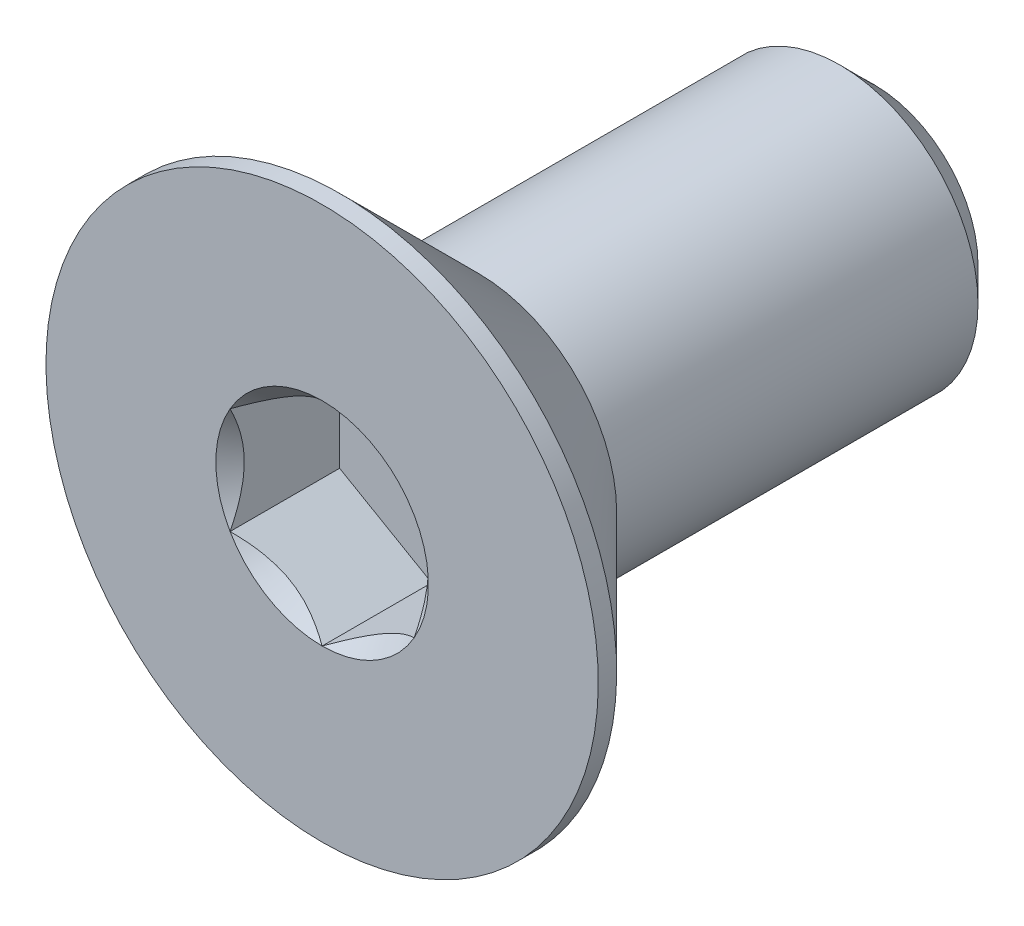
ISO-10303-21;
HEADER;
FILE_DESCRIPTION(('STEP AP214'),'2;1');
FILE_NAME('part.step','',(''),(''),'','','');
FILE_SCHEMA(('AUTOMOTIVE_DESIGN { 1 0 10303 214 1 1 1 1 }'));
ENDSEC;
DATA;
#1=APPLICATION_CONTEXT('core data for automotive mechanical design processes');
#2=APPLICATION_PROTOCOL_DEFINITION('international standard','automotive_design',2000,#1);
#3=PRODUCT_CONTEXT('',#1,'mechanical');
#4=PRODUCT('Part','Part','',(#3));
#5=PRODUCT_RELATED_PRODUCT_CATEGORY('part','',(#4));
#6=PRODUCT_DEFINITION_FORMATION('','',#4);
#7=PRODUCT_DEFINITION_CONTEXT('part definition',#1,'design');
#8=PRODUCT_DEFINITION('design','',#6,#7);
#9=PRODUCT_DEFINITION_SHAPE('','',#8);
#10=(LENGTH_UNIT() NAMED_UNIT(*) SI_UNIT(.MILLI.,.METRE.));
#11=(NAMED_UNIT(*) PLANE_ANGLE_UNIT() SI_UNIT($,.RADIAN.));
#12=(NAMED_UNIT(*) SI_UNIT($,.STERADIAN.) SOLID_ANGLE_UNIT());
#13=UNCERTAINTY_MEASURE_WITH_UNIT(LENGTH_MEASURE(1.E-05),#10,'distance_accuracy_value','');
#14=(GEOMETRIC_REPRESENTATION_CONTEXT(3) GLOBAL_UNCERTAINTY_ASSIGNED_CONTEXT((#13)) GLOBAL_UNIT_ASSIGNED_CONTEXT((#10,
#11,#12)) REPRESENTATION_CONTEXT('',''));
#15=CARTESIAN_POINT('',(0.,0.,0.));
#16=DIRECTION('',(0.,0.,1.));
#17=DIRECTION('',(1.,0.,0.));
#18=AXIS2_PLACEMENT_3D('',#15,#16,#17);
#19=CARTESIAN_POINT('',(0.,0.,-6.));
#20=DIRECTION('',(0.,0.,-1.));
#21=DIRECTION('',(0.,1.,0.));
#22=AXIS2_PLACEMENT_3D('',#19,#20,#21);
#23=CYLINDRICAL_SURFACE('',#22,1.5);
#24=CARTESIAN_POINT('',(0.,0.,-5.625));
#25=DIRECTION('',(0.,0.,-1.));
#26=DIRECTION('',(0.,1.,0.));
#27=AXIS2_PLACEMENT_3D('',#24,#25,#26);
#28=CIRCLE('',#27,1.5);
#29=CARTESIAN_POINT('',(0.,-1.5,-5.625));
#30=VERTEX_POINT('',#29);
#31=EDGE_CURVE('E49',#30,#30,#28,.F.);
#32=ORIENTED_EDGE('',*,*,#31,.T.);
#33=EDGE_LOOP('',(#32));
#34=FACE_BOUND('',#33,.T.);
#35=CARTESIAN_POINT('',(0.,0.,-1.7));
#36=DIRECTION('',(0.,0.,1.));
#37=DIRECTION('',(0.,-1.,0.));
#38=AXIS2_PLACEMENT_3D('',#35,#36,#37);
#39=CIRCLE('',#38,1.5);
#40=CARTESIAN_POINT('',(0.,-1.5,-1.7));
#41=VERTEX_POINT('',#40);
#42=EDGE_CURVE('E167',#41,#41,#39,.T.);
#43=ORIENTED_EDGE('',*,*,#42,.F.);
#44=EDGE_LOOP('',(#43));
#45=FACE_BOUND('',#44,.T.);
#46=ADVANCED_FACE('F36',(#34,#45),#23,.T.);
#47=CARTESIAN_POINT('',(0.,-1.5,-6.));
#48=DIRECTION('',(0.,0.,-1.));
#49=DIRECTION('',(0.,1.,0.));
#50=AXIS2_PLACEMENT_3D('',#47,#48,#49);
#51=PLANE('',#50);
#52=CARTESIAN_POINT('',(0.,0.,-6.));
#53=DIRECTION('',(0.,0.,-1.));
#54=DIRECTION('',(0.,1.,0.));
#55=AXIS2_PLACEMENT_3D('',#52,#53,#54);
#56=CIRCLE('',#55,1.125);
#57=CARTESIAN_POINT('',(0.,-1.125,-6.));
#58=VERTEX_POINT('',#57);
#59=EDGE_CURVE('E176',#58,#58,#56,.T.);
#60=ORIENTED_EDGE('',*,*,#59,.T.);
#61=EDGE_LOOP('',(#60));
#62=FACE_BOUND('',#61,.T.);
#63=ADVANCED_FACE('F186',(#62),#51,.T.);
#64=CARTESIAN_POINT('',(0.,0.,-6.));
#65=DIRECTION('',(0.,0.,1.));
#66=DIRECTION('',(0.,-1.,0.));
#67=AXIS2_PLACEMENT_3D('',#64,#65,#66);
#68=CONICAL_SURFACE('',#67,1.125,0.785398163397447);
#69=CARTESIAN_POINT('',(0.,-1.5,-5.625));
#70=CARTESIAN_POINT('',(0.,-1.49609375,-5.62890625));
#71=CARTESIAN_POINT('',(0.,-1.4921875,-5.6328125));
#72=CARTESIAN_POINT('',(0.,-1.484375,-5.640625));
#73=CARTESIAN_POINT('',(0.,-1.48046875,-5.64453125));
#74=CARTESIAN_POINT('',(0.,-1.47265625,-5.65234375));
#75=CARTESIAN_POINT('',(0.,-1.46875,-5.65625));
#76=CARTESIAN_POINT('',(0.,-1.4609375,-5.6640625));
#77=CARTESIAN_POINT('',(0.,-1.45703125,-5.66796875));
#78=CARTESIAN_POINT('',(0.,-1.44921875,-5.67578125));
#79=CARTESIAN_POINT('',(0.,-1.4453125,-5.6796875));
#80=CARTESIAN_POINT('',(0.,-1.4375,-5.6875));
#81=CARTESIAN_POINT('',(0.,-1.43359375,-5.69140625));
#82=CARTESIAN_POINT('',(0.,-1.42578125,-5.69921875));
#83=CARTESIAN_POINT('',(0.,-1.421875,-5.703125));
#84=CARTESIAN_POINT('',(0.,-1.4140625,-5.7109375));
#85=CARTESIAN_POINT('',(0.,-1.41015625,-5.71484375));
#86=CARTESIAN_POINT('',(0.,-1.40234375,-5.72265625));
#87=CARTESIAN_POINT('',(0.,-1.3984375,-5.7265625));
#88=CARTESIAN_POINT('',(0.,-1.390625,-5.734375));
#89=CARTESIAN_POINT('',(0.,-1.38671875,-5.73828125));
#90=CARTESIAN_POINT('',(0.,-1.37890625,-5.74609375));
#91=CARTESIAN_POINT('',(0.,-1.375,-5.75));
#92=CARTESIAN_POINT('',(0.,-1.3671875,-5.7578125));
#93=CARTESIAN_POINT('',(0.,-1.36328125,-5.76171875));
#94=CARTESIAN_POINT('',(0.,-1.35546875,-5.76953125));
#95=CARTESIAN_POINT('',(0.,-1.3515625,-5.7734375));
#96=CARTESIAN_POINT('',(0.,-1.34375,-5.78125));
#97=CARTESIAN_POINT('',(0.,-1.33984375,-5.78515625));
#98=CARTESIAN_POINT('',(0.,-1.33203125,-5.79296875));
#99=CARTESIAN_POINT('',(0.,-1.328125,-5.796875));
#100=CARTESIAN_POINT('',(0.,-1.3203125,-5.8046875));
#101=CARTESIAN_POINT('',(0.,-1.31640625,-5.80859375));
#102=CARTESIAN_POINT('',(0.,-1.30859375,-5.81640625));
#103=CARTESIAN_POINT('',(0.,-1.3046875,-5.8203125));
#104=CARTESIAN_POINT('',(0.,-1.296875,-5.828125));
#105=CARTESIAN_POINT('',(0.,-1.29296875,-5.83203125));
#106=CARTESIAN_POINT('',(0.,-1.28515625,-5.83984375));
#107=CARTESIAN_POINT('',(0.,-1.28125,-5.84375));
#108=CARTESIAN_POINT('',(0.,-1.2734375,-5.8515625));
#109=CARTESIAN_POINT('',(0.,-1.26953125,-5.85546875));
#110=CARTESIAN_POINT('',(0.,-1.26171875,-5.86328125));
#111=CARTESIAN_POINT('',(0.,-1.2578125,-5.8671875));
#112=CARTESIAN_POINT('',(0.,-1.25,-5.875));
#113=CARTESIAN_POINT('',(0.,-1.24609375,-5.87890625));
#114=CARTESIAN_POINT('',(0.,-1.23828125,-5.88671875));
#115=CARTESIAN_POINT('',(0.,-1.234375,-5.890625));
#116=CARTESIAN_POINT('',(0.,-1.2265625,-5.8984375));
#117=CARTESIAN_POINT('',(0.,-1.22265625,-5.90234375));
#118=CARTESIAN_POINT('',(0.,-1.21484375,-5.91015625));
#119=CARTESIAN_POINT('',(0.,-1.2109375,-5.9140625));
#120=CARTESIAN_POINT('',(0.,-1.203125,-5.921875));
#121=CARTESIAN_POINT('',(0.,-1.19921875,-5.92578125));
#122=CARTESIAN_POINT('',(0.,-1.19140625,-5.93359375));
#123=CARTESIAN_POINT('',(0.,-1.1875,-5.9375));
#124=CARTESIAN_POINT('',(0.,-1.1796875,-5.9453125));
#125=CARTESIAN_POINT('',(0.,-1.17578125,-5.94921875));
#126=CARTESIAN_POINT('',(0.,-1.16796875,-5.95703125));
#127=CARTESIAN_POINT('',(0.,-1.1640625,-5.9609375));
#128=CARTESIAN_POINT('',(0.,-1.15625,-5.96875));
#129=CARTESIAN_POINT('',(0.,-1.15234375,-5.97265625));
#130=CARTESIAN_POINT('',(0.,-1.14453125,-5.98046875));
#131=CARTESIAN_POINT('',(0.,-1.140625,-5.984375));
#132=CARTESIAN_POINT('',(0.,-1.1328125,-5.9921875));
#133=CARTESIAN_POINT('',(0.,-1.12890625,-5.99609375));
#134=CARTESIAN_POINT('',(0.,-1.125,-6.));
#135=B_SPLINE_CURVE_WITH_KNOTS('',3,(#69,#70,#71,#72,#73,#74,#75,#76,#77,#78,#79,#80,#81,#82,
#83,#84,#85,#86,#87,#88,#89,#90,#91,#92,#93,#94,#95,#96,#97,#98,#99,#100,#101,#102,#103,#104,
#105,#106,#107,#108,#109,#110,#111,#112,#113,#114,#115,#116,#117,#118,#119,#120,#121,#122,#123,
#124,#125,#126,#127,#128,#129,#130,#131,#132,#133,#134),.UNSPECIFIED.,.F.,.F.,(4,2,2,2,2,2,2,2,
2,2,2,2,2,2,2,2,2,2,2,2,2,2,2,2,2,2,2,2,2,2,2,2,4),(0.,0.0165728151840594,0.0331456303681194,
0.0497184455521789,0.0662912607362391,0.0828640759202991,0.0994368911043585,0.116009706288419,
0.132582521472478,0.149155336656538,0.165728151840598,0.182300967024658,0.198873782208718,
0.215446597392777,0.232019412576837,0.248592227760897,0.265165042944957,0.281737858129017,
0.298310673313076,0.314883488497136,0.331456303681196,0.348029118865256,0.364601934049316,
0.381174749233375,0.397747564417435,0.414320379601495,0.430893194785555,0.447466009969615,
0.464038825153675,0.480611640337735,0.497184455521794,0.513757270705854,0.530330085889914),.UNSPECIFIED.);
#136=EDGE_CURVE('BSEAM38',#30,#58,#135,.T.);
#137=ORIENTED_EDGE('',*,*,#31,.F.);
#138=ORIENTED_EDGE('',*,*,#59,.F.);
#139=ORIENTED_EDGE('',*,*,#136,.T.);
#140=ORIENTED_EDGE('',*,*,#136,.F.);
#141=EDGE_LOOP('',(#137,#139,#138,#140));
#142=FACE_BOUND('',#141,.T.);
#143=ADVANCED_FACE('F38',(#142),#68,.T.);
#144=CARTESIAN_POINT('',(0.,0.,0.));
#145=DIRECTION('',(0.,0.,1.));
#146=DIRECTION('',(0.,-1.,0.));
#147=AXIS2_PLACEMENT_3D('',#144,#145,#146);
#148=CYLINDRICAL_SURFACE('',#147,3.);
#149=CARTESIAN_POINT('',(0.,0.,0.));
#150=DIRECTION('',(0.,0.,1.));
#151=DIRECTION('',(0.,-1.,0.));
#152=AXIS2_PLACEMENT_3D('',#149,#150,#151);
#153=CIRCLE('',#152,3.);
#154=CARTESIAN_POINT('',(0.,-3.,0.));
#155=VERTEX_POINT('',#154);
#156=EDGE_CURVE('E173',#155,#155,#153,.T.);
#157=ORIENTED_EDGE('',*,*,#156,.F.);
#158=EDGE_LOOP('',(#157));
#159=FACE_BOUND('',#158,.T.);
#160=CARTESIAN_POINT('',(0.,0.,-0.200000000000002));
#161=DIRECTION('',(0.,0.,1.));
#162=DIRECTION('',(0.,-1.,0.));
#163=AXIS2_PLACEMENT_3D('',#160,#161,#162);
#164=CIRCLE('',#163,3.);
#165=CARTESIAN_POINT('',(0.,-3.,-0.199999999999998));
#166=VERTEX_POINT('',#165);
#167=EDGE_CURVE('E170',#166,#166,#164,.T.);
#168=ORIENTED_EDGE('',*,*,#167,.T.);
#169=EDGE_LOOP('',(#168));
#170=FACE_BOUND('',#169,.T.);
#171=ADVANCED_FACE('F185',(#159,#170),#148,.T.);
#172=CARTESIAN_POINT('',(0.,0.,-1.7));
#173=DIRECTION('',(0.,0.,1.));
#174=DIRECTION('',(0.,-1.,0.));
#175=AXIS2_PLACEMENT_3D('',#172,#173,#174);
#176=CONICAL_SURFACE('',#175,1.5,0.785398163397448);
#177=ORIENTED_EDGE('',*,*,#167,.F.);
#178=EDGE_LOOP('',(#177));
#179=FACE_BOUND('',#178,.T.);
#180=ORIENTED_EDGE('',*,*,#42,.T.);
#181=EDGE_LOOP('',(#180));
#182=FACE_BOUND('',#181,.T.);
#183=ADVANCED_FACE('F196',(#179,#182),#176,.T.);
#184=CARTESIAN_POINT('',(0.,-1.5,0.));
#185=DIRECTION('',(0.,0.,1.));
#186=DIRECTION('',(0.,-1.,0.));
#187=AXIS2_PLACEMENT_3D('',#184,#185,#186);
#188=PLANE('',#187);
#189=CARTESIAN_POINT('',(0.,0.,0.));
#190=DIRECTION('',(0.,0.,1.));
#191=DIRECTION('',(1.,0.,0.));
#192=AXIS2_PLACEMENT_3D('',#189,#190,#191);
#193=CIRCLE('',#192,1.15470053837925);
#194=CARTESIAN_POINT('',(0.,-1.15470053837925,0.));
#195=VERTEX_POINT('',#194);
#196=CARTESIAN_POINT('',(0.999999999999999,-0.577350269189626,0.));
#197=VERTEX_POINT('',#196);
#198=EDGE_CURVE('E95',#195,#197,#193,.T.);
#199=ORIENTED_EDGE('',*,*,#198,.F.);
#200=CARTESIAN_POINT('',(-1.,-0.577350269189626,0.));
#201=VERTEX_POINT('',#200);
#202=EDGE_CURVE('E55',#201,#195,#193,.T.);
#203=ORIENTED_EDGE('',*,*,#202,.F.);
#204=CARTESIAN_POINT('',(-0.999999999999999,0.577350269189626,0.));
#205=VERTEX_POINT('',#204);
#206=EDGE_CURVE('E137',#205,#201,#193,.T.);
#207=ORIENTED_EDGE('',*,*,#206,.F.);
#208=CARTESIAN_POINT('',(0.,1.15470053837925,0.));
#209=VERTEX_POINT('',#208);
#210=EDGE_CURVE('E62',#209,#205,#193,.T.);
#211=ORIENTED_EDGE('',*,*,#210,.F.);
#212=CARTESIAN_POINT('',(0.999999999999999,0.577350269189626,0.));
#213=VERTEX_POINT('',#212);
#214=EDGE_CURVE('E131',#213,#209,#193,.T.);
#215=ORIENTED_EDGE('',*,*,#214,.F.);
#216=EDGE_CURVE('E103',#197,#213,#193,.T.);
#217=ORIENTED_EDGE('',*,*,#216,.F.);
#218=EDGE_LOOP('',(#199,#203,#207,#211,#215,#217));
#219=FACE_BOUND('',#218,.T.);
#220=ORIENTED_EDGE('',*,*,#156,.T.);
#221=EDGE_LOOP('',(#220));
#222=FACE_BOUND('',#221,.T.);
#223=ADVANCED_FACE('F129',(#219,#222),#188,.T.);
#224=CARTESIAN_POINT('',(0.,0.,0.));
#225=DIRECTION('',(0.,0.,1.));
#226=DIRECTION('',(1.,0.,0.));
#227=AXIS2_PLACEMENT_3D('',#224,#225,#226);
#228=CONICAL_SURFACE('',#227,1.15470053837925,0.78539816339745);
#229=ORIENTED_EDGE('',*,*,#216,.T.);
#230=CARTESIAN_POINT('',(0.999999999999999,-1.15147208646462,0.370385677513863));
#231=CARTESIAN_POINT('',(0.999999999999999,-1.12343447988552,0.349219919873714));
#232=CARTESIAN_POINT('',(0.999999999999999,-1.09524064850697,0.328261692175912));
#233=CARTESIAN_POINT('',(0.999999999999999,-1.03847715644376,0.286846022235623));
#234=CARTESIAN_POINT('',(0.999999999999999,-1.00990740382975,0.26638870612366));
#235=CARTESIAN_POINT('',(0.999999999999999,-0.923120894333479,0.20560479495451));
#236=CARTESIAN_POINT('',(0.999999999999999,-0.864253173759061,0.166192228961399));
#237=CARTESIAN_POINT('',(0.999999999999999,-0.740809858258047,0.0888206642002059));
#238=CARTESIAN_POINT('',(0.999999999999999,-0.676100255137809,0.0510730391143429));
#239=CARTESIAN_POINT('',(0.999999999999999,-0.543448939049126,-0.017975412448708));
#240=CARTESIAN_POINT('',(0.999999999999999,-0.47551911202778,-0.0492979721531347));
#241=CARTESIAN_POINT('',(0.999999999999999,-0.37355585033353,-0.0876182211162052));
#242=CARTESIAN_POINT('',(0.999999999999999,-0.341031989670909,-0.0986164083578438));
#243=CARTESIAN_POINT('',(0.999999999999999,-0.275199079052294,-0.11800165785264));
#244=CARTESIAN_POINT('',(0.999999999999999,-0.241889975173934,-0.126388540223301));
#245=CARTESIAN_POINT('',(0.999999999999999,-0.175247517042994,-0.139974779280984));
#246=CARTESIAN_POINT('',(0.999999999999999,-0.141925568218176,-0.145229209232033));
#247=CARTESIAN_POINT('',(0.999999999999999,-0.0749144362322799,-0.152451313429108));
#248=CARTESIAN_POINT('',(0.999999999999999,-0.0412251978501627,-0.154418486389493));
#249=CARTESIAN_POINT('',(0.999999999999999,0.0249580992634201,-0.15491680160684));
#250=CARTESIAN_POINT('',(0.999999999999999,0.0574512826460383,-0.153569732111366));
#251=CARTESIAN_POINT('',(0.999999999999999,0.122148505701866,-0.147783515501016));
#252=CARTESIAN_POINT('',(0.999999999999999,0.154352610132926,-0.143345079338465));
#253=CARTESIAN_POINT('',(0.999999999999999,0.218799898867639,-0.131543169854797));
#254=CARTESIAN_POINT('',(0.999999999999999,0.251033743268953,-0.124129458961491));
#255=CARTESIAN_POINT('',(0.999999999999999,0.314797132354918,-0.106771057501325));
#256=CARTESIAN_POINT('',(0.999999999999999,0.346326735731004,-0.0968265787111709));
#257=CARTESIAN_POINT('',(0.999999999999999,0.445594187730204,-0.0617765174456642));
#258=CARTESIAN_POINT('',(0.999999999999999,0.511919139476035,-0.0326791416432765));
#259=CARTESIAN_POINT('',(0.999999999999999,0.64145324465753,0.0320153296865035));
#260=CARTESIAN_POINT('',(0.999999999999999,0.704650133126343,0.0676357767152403));
#261=CARTESIAN_POINT('',(0.999999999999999,0.825428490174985,0.141123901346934));
#262=CARTESIAN_POINT('',(0.999999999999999,0.883132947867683,0.178791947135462));
#263=CARTESIAN_POINT('',(0.999999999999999,0.968148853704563,0.237022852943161));
#264=CARTESIAN_POINT('',(0.999999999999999,0.996120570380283,0.256638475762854));
#265=CARTESIAN_POINT('',(0.999999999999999,1.05168177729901,0.296388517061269));
#266=CARTESIAN_POINT('',(0.999999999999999,1.079271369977,0.316522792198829));
#267=CARTESIAN_POINT('',(0.999999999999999,1.10670185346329,0.336872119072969));
#268=B_SPLINE_CURVE_WITH_KNOTS('',3,(#230,#231,#232,#233,#234,#235,#236,#237,#238,#239,#240,
#241,#242,#243,#244,#245,#246,#247,#248,#249,#250,#251,#252,#253,#254,#255,#256,#257,#258,#259,
#260,#261,#262,#263,#264,#265,#266,#267),.UNSPECIFIED.,.F.,.F.,(4,2,2,2,2,2,2,2,2,2,2,2,2,2,2,2,
2,2,4),(0.,0.105386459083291,0.210799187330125,0.42323361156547,0.647793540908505,
0.871580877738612,0.974493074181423,1.07741235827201,1.17846428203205,1.27953161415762,
1.37694086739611,1.47432772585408,1.57343322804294,1.67253043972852,1.88917353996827,
2.10660791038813,2.31323734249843,2.41572589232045,2.51818641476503),.UNSPECIFIED.);
#269=EDGE_CURVE('E11',#197,#213,#268,.T.);
#270=ORIENTED_EDGE('',*,*,#269,.F.);
#271=EDGE_LOOP('',(#229,#270));
#272=FACE_BOUND('',#271,.T.);
#273=ADVANCED_FACE('F107',(#272),#228,.F.);
#274=ORIENTED_EDGE('',*,*,#214,.T.);
#275=CARTESIAN_POINT('',(1.0002,0.577234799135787,0.000115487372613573));
#276=CARTESIAN_POINT('',(0.965817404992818,0.597085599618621,-0.0197220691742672));
#277=CARTESIAN_POINT('',(0.930859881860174,0.617268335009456,-0.0383949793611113));
#278=CARTESIAN_POINT('',(0.85957719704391,0.658423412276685,-0.0725852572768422));
#279=CARTESIAN_POINT('',(0.823245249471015,0.679399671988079,-0.0880835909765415));
#280=CARTESIAN_POINT('',(0.749983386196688,0.721697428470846,-0.114632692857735));
#281=CARTESIAN_POINT('',(0.713072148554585,0.743008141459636,-0.125750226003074));
#282=CARTESIAN_POINT('',(0.63843727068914,0.786098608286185,-0.142880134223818));
#283=CARTESIAN_POINT('',(0.600715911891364,0.80787704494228,-0.148905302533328));
#284=CARTESIAN_POINT('',(0.535707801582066,0.845409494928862,-0.154339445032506));
#285=CARTESIAN_POINT('',(0.508505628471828,0.861114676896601,-0.155143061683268));
#286=CARTESIAN_POINT('',(0.454153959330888,0.892494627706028,-0.153793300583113));
#287=CARTESIAN_POINT('',(0.427004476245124,0.908169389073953,-0.151639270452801));
#288=CARTESIAN_POINT('',(0.34594372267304,0.95496983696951,-0.140883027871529));
#289=CARTESIAN_POINT('',(0.292435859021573,0.985862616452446,-0.127985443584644));
#290=CARTESIAN_POINT('',(0.198523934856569,1.04008269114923,-0.0968592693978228));
#291=CARTESIAN_POINT('',(0.157679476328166,1.0636642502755,-0.0802622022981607));
#292=CARTESIAN_POINT('',(0.0775903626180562,1.1099037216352,-0.0428750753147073));
#293=CARTESIAN_POINT('',(0.0383409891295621,1.1325643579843,-0.0220986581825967));
#294=CARTESIAN_POINT('',(-0.000200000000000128,1.15481600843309,0.000115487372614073));
#295=B_SPLINE_CURVE_WITH_KNOTS('',3,(#275,#276,#277,#278,#279,#280,#281,#282,#283,#284,#285,
#286,#287,#288,#289,#290,#291,#292,#293,#294),.UNSPECIFIED.,.F.,.F.,(4,2,2,2,2,2,2,2,2,4),(0.,
0.133237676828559,0.26725222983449,0.3991370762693,0.530689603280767,0.624814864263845,
0.718960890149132,0.907306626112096,1.05710100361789,1.20641411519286),.UNSPECIFIED.);
#296=EDGE_CURVE('E133',#213,#209,#295,.T.);
#297=ORIENTED_EDGE('',*,*,#296,.F.);
#298=EDGE_LOOP('',(#274,#297));
#299=FACE_BOUND('',#298,.T.);
#300=ADVANCED_FACE('F272',(#299),#228,.F.);
#301=ORIENTED_EDGE('',*,*,#210,.T.);
#302=CARTESIAN_POINT('',(0.000199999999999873,1.15481600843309,0.000115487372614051));
#303=CARTESIAN_POINT('',(-0.0341825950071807,1.13496520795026,-0.0197220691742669));
#304=CARTESIAN_POINT('',(-0.0691401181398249,1.11478247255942,-0.038394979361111));
#305=CARTESIAN_POINT('',(-0.140422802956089,1.07362739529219,-0.0725852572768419));
#306=CARTESIAN_POINT('',(-0.176754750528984,1.0526511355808,-0.0880835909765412));
#307=CARTESIAN_POINT('',(-0.250016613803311,1.01035337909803,-0.114632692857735));
#308=CARTESIAN_POINT('',(-0.286927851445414,0.98904266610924,-0.125750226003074));
#309=CARTESIAN_POINT('',(-0.361562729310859,0.945952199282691,-0.142880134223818));
#310=CARTESIAN_POINT('',(-0.399284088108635,0.924173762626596,-0.148905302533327));
#311=CARTESIAN_POINT('',(-0.464292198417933,0.886641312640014,-0.154339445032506));
#312=CARTESIAN_POINT('',(-0.491494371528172,0.870936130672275,-0.155143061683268));
#313=CARTESIAN_POINT('',(-0.545846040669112,0.839556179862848,-0.153793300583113));
#314=CARTESIAN_POINT('',(-0.572995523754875,0.823881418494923,-0.1516392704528));
#315=CARTESIAN_POINT('',(-0.65405627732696,0.777080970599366,-0.140883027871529));
#316=CARTESIAN_POINT('',(-0.707564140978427,0.74618819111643,-0.127985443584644));
#317=CARTESIAN_POINT('',(-0.801476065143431,0.691968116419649,-0.0968592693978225));
#318=CARTESIAN_POINT('',(-0.842320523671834,0.668386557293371,-0.0802622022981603));
#319=CARTESIAN_POINT('',(-0.922409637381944,0.622147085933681,-0.0428750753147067));
#320=CARTESIAN_POINT('',(-0.961659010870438,0.599486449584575,-0.022098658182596));
#321=CARTESIAN_POINT('',(-1.0002,0.577234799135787,0.000115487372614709));
#322=B_SPLINE_CURVE_WITH_KNOTS('',3,(#302,#303,#304,#305,#306,#307,#308,#309,#310,#311,#312,
#313,#314,#315,#316,#317,#318,#319,#320,#321),.UNSPECIFIED.,.F.,.F.,(4,2,2,2,2,2,2,2,2,4),(0.,
0.133237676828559,0.26725222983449,0.3991370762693,0.530689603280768,0.624814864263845,
0.718960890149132,0.907306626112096,1.05710100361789,1.20641411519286),.UNSPECIFIED.);
#323=EDGE_CURVE('E136',#209,#205,#322,.T.);
#324=ORIENTED_EDGE('',*,*,#323,.F.);
#325=EDGE_LOOP('',(#301,#324));
#326=FACE_BOUND('',#325,.T.);
#327=ADVANCED_FACE('F268',(#326),#228,.F.);
#328=ORIENTED_EDGE('',*,*,#206,.T.);
#329=CARTESIAN_POINT('',(-1.,-1.15147208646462,0.370385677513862));
#330=CARTESIAN_POINT('',(-1.,-1.12343447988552,0.349219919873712));
#331=CARTESIAN_POINT('',(-1.,-1.09524064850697,0.32826169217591));
#332=CARTESIAN_POINT('',(-1.,-1.03847715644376,0.286846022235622));
#333=CARTESIAN_POINT('',(-1.,-1.00990740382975,0.266388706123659));
#334=CARTESIAN_POINT('',(-1.,-0.923120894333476,0.20560479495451));
#335=CARTESIAN_POINT('',(-1.,-0.864253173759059,0.166192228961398));
#336=CARTESIAN_POINT('',(-1.,-0.740809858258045,0.0888206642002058));
#337=CARTESIAN_POINT('',(-1.,-0.676100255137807,0.0510730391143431));
#338=CARTESIAN_POINT('',(-1.,-0.543448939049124,-0.0179754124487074));
#339=CARTESIAN_POINT('',(-1.,-0.475519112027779,-0.0492979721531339));
#340=CARTESIAN_POINT('',(-1.,-0.373555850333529,-0.0876182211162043));
#341=CARTESIAN_POINT('',(-1.,-0.341031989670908,-0.0986164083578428));
#342=CARTESIAN_POINT('',(-1.,-0.275199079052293,-0.118001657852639));
#343=CARTESIAN_POINT('',(-1.,-0.241889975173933,-0.1263885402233));
#344=CARTESIAN_POINT('',(-1.,-0.175247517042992,-0.139974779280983));
#345=CARTESIAN_POINT('',(-1.,-0.141925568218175,-0.145229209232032));
#346=CARTESIAN_POINT('',(-1.,-0.0749144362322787,-0.152451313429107));
#347=CARTESIAN_POINT('',(-1.,-0.0412251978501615,-0.154418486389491));
#348=CARTESIAN_POINT('',(-1.,0.0249580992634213,-0.154916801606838));
#349=CARTESIAN_POINT('',(-1.,0.0574512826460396,-0.153569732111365));
#350=CARTESIAN_POINT('',(-1.,0.122148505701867,-0.147783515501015));
#351=CARTESIAN_POINT('',(-1.,0.154352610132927,-0.143345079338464));
#352=CARTESIAN_POINT('',(-1.,0.21879989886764,-0.131543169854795));
#353=CARTESIAN_POINT('',(-1.,0.251033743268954,-0.12412945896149));
#354=CARTESIAN_POINT('',(-1.,0.314797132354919,-0.106771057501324));
#355=CARTESIAN_POINT('',(-1.,0.346326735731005,-0.0968265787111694));
#356=CARTESIAN_POINT('',(-1.,0.445594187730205,-0.0617765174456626));
#357=CARTESIAN_POINT('',(-1.,0.511919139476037,-0.0326791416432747));
#358=CARTESIAN_POINT('',(-1.,0.641453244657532,0.0320153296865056));
#359=CARTESIAN_POINT('',(-1.,0.704650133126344,0.0676357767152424));
#360=CARTESIAN_POINT('',(-1.,0.825428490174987,0.141123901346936));
#361=CARTESIAN_POINT('',(-1.,0.883132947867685,0.178791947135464));
#362=CARTESIAN_POINT('',(-1.,0.968148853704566,0.237022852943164));
#363=CARTESIAN_POINT('',(-1.,0.996120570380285,0.256638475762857));
#364=CARTESIAN_POINT('',(-1.,1.05168177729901,0.296388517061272));
#365=CARTESIAN_POINT('',(-1.,1.079271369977,0.316522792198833));
#366=CARTESIAN_POINT('',(-1.,1.10670185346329,0.336872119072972));
#367=B_SPLINE_CURVE_WITH_KNOTS('',3,(#329,#330,#331,#332,#333,#334,#335,#336,#337,#338,#339,
#340,#341,#342,#343,#344,#345,#346,#347,#348,#349,#350,#351,#352,#353,#354,#355,#356,#357,#358,
#359,#360,#361,#362,#363,#364,#365,#366),.UNSPECIFIED.,.F.,.F.,(4,2,2,2,2,2,2,2,2,2,2,2,2,2,2,2,
2,2,4),(0.,0.105386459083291,0.210799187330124,0.423233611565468,0.647793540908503,
0.871580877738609,0.97449307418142,1.07741235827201,1.17846428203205,1.27953161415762,
1.3769408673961,1.47432772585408,1.57343322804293,1.67253043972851,1.88917353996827,
2.10660791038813,2.31323734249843,2.41572589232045,2.51818641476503),.UNSPECIFIED.);
#368=EDGE_CURVE('E143',#205,#201,#367,.F.);
#369=ORIENTED_EDGE('',*,*,#368,.F.);
#370=EDGE_LOOP('',(#328,#369));
#371=FACE_BOUND('',#370,.T.);
#372=ADVANCED_FACE('F141',(#371),#228,.F.);
#373=ORIENTED_EDGE('',*,*,#202,.T.);
#374=CARTESIAN_POINT('',(-1.0002,-0.577234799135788,0.000115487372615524));
#375=CARTESIAN_POINT('',(-0.96581740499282,-0.597085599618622,-0.0197220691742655));
#376=CARTESIAN_POINT('',(-0.930859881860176,-0.617268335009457,-0.0383949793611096));
#377=CARTESIAN_POINT('',(-0.859577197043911,-0.658423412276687,-0.0725852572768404));
#378=CARTESIAN_POINT('',(-0.823245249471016,-0.67939967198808,-0.0880835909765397));
#379=CARTESIAN_POINT('',(-0.74998338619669,-0.721697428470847,-0.114632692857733));
#380=CARTESIAN_POINT('',(-0.713072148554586,-0.743008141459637,-0.125750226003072));
#381=CARTESIAN_POINT('',(-0.638437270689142,-0.786098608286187,-0.142880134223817));
#382=CARTESIAN_POINT('',(-0.600715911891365,-0.807877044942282,-0.148905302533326));
#383=CARTESIAN_POINT('',(-0.535707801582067,-0.845409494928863,-0.154339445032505));
#384=CARTESIAN_POINT('',(-0.508505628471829,-0.861114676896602,-0.155143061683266));
#385=CARTESIAN_POINT('',(-0.454153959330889,-0.89249462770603,-0.153793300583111));
#386=CARTESIAN_POINT('',(-0.427004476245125,-0.908169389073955,-0.151639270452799));
#387=CARTESIAN_POINT('',(-0.345943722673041,-0.954969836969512,-0.140883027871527));
#388=CARTESIAN_POINT('',(-0.292435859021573,-0.985862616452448,-0.127985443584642));
#389=CARTESIAN_POINT('',(-0.198523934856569,-1.04008269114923,-0.096859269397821));
#390=CARTESIAN_POINT('',(-0.157679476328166,-1.06366425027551,-0.0802622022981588));
#391=CARTESIAN_POINT('',(-0.0775903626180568,-1.1099037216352,-0.0428750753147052));
#392=CARTESIAN_POINT('',(-0.0383409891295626,-1.1325643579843,-0.0220986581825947));
#393=CARTESIAN_POINT('',(0.000199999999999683,-1.15481600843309,0.000115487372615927));
#394=B_SPLINE_CURVE_WITH_KNOTS('',3,(#374,#375,#376,#377,#378,#379,#380,#381,#382,#383,#384,
#385,#386,#387,#388,#389,#390,#391,#392,#393),.UNSPECIFIED.,.F.,.F.,(4,2,2,2,2,2,2,2,2,4),(0.,
0.133237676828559,0.26725222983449,0.3991370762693,0.530689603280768,0.624814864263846,
0.718960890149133,0.907306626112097,1.05710100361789,1.20641411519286),.UNSPECIFIED.);
#395=EDGE_CURVE('E119',#201,#195,#394,.T.);
#396=ORIENTED_EDGE('',*,*,#395,.F.);
#397=EDGE_LOOP('',(#373,#396));
#398=FACE_BOUND('',#397,.T.);
#399=ADVANCED_FACE('F223',(#398),#228,.F.);
#400=ORIENTED_EDGE('',*,*,#198,.T.);
#401=CARTESIAN_POINT('',(-0.000200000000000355,-1.15481600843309,0.000115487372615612));
#402=CARTESIAN_POINT('',(0.0341825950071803,-1.13496520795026,-0.0197220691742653));
#403=CARTESIAN_POINT('',(0.0691401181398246,-1.11478247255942,-0.0383949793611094));
#404=CARTESIAN_POINT('',(0.140422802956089,-1.07362739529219,-0.0725852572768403));
#405=CARTESIAN_POINT('',(0.176754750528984,-1.0526511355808,-0.0880835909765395));
#406=CARTESIAN_POINT('',(0.250016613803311,-1.01035337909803,-0.114632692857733));
#407=CARTESIAN_POINT('',(0.286927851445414,-0.989042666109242,-0.125750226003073));
#408=CARTESIAN_POINT('',(0.361562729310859,-0.945952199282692,-0.142880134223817));
#409=CARTESIAN_POINT('',(0.399284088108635,-0.924173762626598,-0.148905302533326));
#410=CARTESIAN_POINT('',(0.464292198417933,-0.886641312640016,-0.154339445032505));
#411=CARTESIAN_POINT('',(0.491494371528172,-0.870936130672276,-0.155143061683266));
#412=CARTESIAN_POINT('',(0.545846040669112,-0.839556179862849,-0.153793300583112));
#413=CARTESIAN_POINT('',(0.572995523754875,-0.823881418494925,-0.151639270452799));
#414=CARTESIAN_POINT('',(0.65405627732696,-0.777080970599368,-0.140883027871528));
#415=CARTESIAN_POINT('',(0.707564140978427,-0.746188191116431,-0.127985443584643));
#416=CARTESIAN_POINT('',(0.801476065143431,-0.69196811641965,-0.0968592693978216));
#417=CARTESIAN_POINT('',(0.842320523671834,-0.668386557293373,-0.0802622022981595));
#418=CARTESIAN_POINT('',(0.922409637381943,-0.622147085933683,-0.0428750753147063));
#419=CARTESIAN_POINT('',(0.961659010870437,-0.599486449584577,-0.0220986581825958));
#420=CARTESIAN_POINT('',(1.0002,-0.577234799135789,0.000115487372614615));
#421=B_SPLINE_CURVE_WITH_KNOTS('',3,(#401,#402,#403,#404,#405,#406,#407,#408,#409,#410,#411,
#412,#413,#414,#415,#416,#417,#418,#419,#420),.UNSPECIFIED.,.F.,.F.,(4,2,2,2,2,2,2,2,2,4),(0.,
0.133237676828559,0.26725222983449,0.3991370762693,0.530689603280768,0.624814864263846,
0.718960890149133,0.907306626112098,1.05710100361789,1.20641411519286),.UNSPECIFIED.);
#422=EDGE_CURVE('E99',#195,#197,#421,.T.);
#423=ORIENTED_EDGE('',*,*,#422,.F.);
#424=EDGE_LOOP('',(#400,#423));
#425=FACE_BOUND('',#424,.T.);
#426=ADVANCED_FACE('F97',(#425),#228,.F.);
#427=CARTESIAN_POINT('',(0.999999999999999,-0.577350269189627,-1.19));
#428=DIRECTION('',(0.,0.,1.));
#429=DIRECTION('',(1.,0.,0.));
#430=AXIS2_PLACEMENT_3D('',#427,#428,#429);
#431=PLANE('',#430);
#432=DIRECTION('',(0.866025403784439,0.5,0.));
#433=VECTOR('',#432,1.);
#434=CARTESIAN_POINT('',(0.,-1.15470053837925,-1.19));
#435=LINE('',#434,#433);
#436=CARTESIAN_POINT('',(0.,-1.15470053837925,-1.19));
#437=VERTEX_POINT('',#436);
#438=CARTESIAN_POINT('',(0.999999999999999,-0.577350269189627,-1.19));
#439=VERTEX_POINT('',#438);
#440=EDGE_CURVE('E118',#437,#439,#435,.T.);
#441=ORIENTED_EDGE('',*,*,#440,.T.);
#442=DIRECTION('',(0.,1.,0.));
#443=VECTOR('',#442,1.);
#444=CARTESIAN_POINT('',(0.999999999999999,-0.577350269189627,-1.19));
#445=LINE('',#444,#443);
#446=CARTESIAN_POINT('',(0.999999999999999,0.577350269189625,-1.19));
#447=VERTEX_POINT('',#446);
#448=EDGE_CURVE('E123',#439,#447,#445,.T.);
#449=ORIENTED_EDGE('',*,*,#448,.T.);
#450=DIRECTION('',(-0.866025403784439,0.5,0.));
#451=VECTOR('',#450,1.);
#452=CARTESIAN_POINT('',(0.999999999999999,0.577350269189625,-1.19));
#453=LINE('',#452,#451);
#454=CARTESIAN_POINT('',(0.,1.15470053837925,-1.19));
#455=VERTEX_POINT('',#454);
#456=EDGE_CURVE('E254',#447,#455,#453,.T.);
#457=ORIENTED_EDGE('',*,*,#456,.T.);
#458=DIRECTION('',(-0.866025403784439,-0.5,0.));
#459=VECTOR('',#458,1.);
#460=CARTESIAN_POINT('',(0.,1.15470053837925,-1.19));
#461=LINE('',#460,#459);
#462=CARTESIAN_POINT('',(-1.,0.577350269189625,-1.19));
#463=VERTEX_POINT('',#462);
#464=EDGE_CURVE('E256',#455,#463,#461,.T.);
#465=ORIENTED_EDGE('',*,*,#464,.T.);
#466=DIRECTION('',(0.,-1.,0.));
#467=VECTOR('',#466,1.);
#468=CARTESIAN_POINT('',(-1.,0.577350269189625,-1.19));
#469=LINE('',#468,#467);
#470=CARTESIAN_POINT('',(-1.,-0.577350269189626,-1.19));
#471=VERTEX_POINT('',#470);
#472=EDGE_CURVE('E158',#463,#471,#469,.T.);
#473=ORIENTED_EDGE('',*,*,#472,.T.);
#474=DIRECTION('',(0.866025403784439,-0.5,0.));
#475=VECTOR('',#474,1.);
#476=CARTESIAN_POINT('',(-1.,-0.577350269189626,-1.19));
#477=LINE('',#476,#475);
#478=EDGE_CURVE('E126',#471,#437,#477,.T.);
#479=ORIENTED_EDGE('',*,*,#478,.T.);
#480=EDGE_LOOP('',(#441,#449,#457,#465,#473,#479));
#481=FACE_BOUND('',#480,.T.);
#482=ADVANCED_FACE('F222',(#481),#431,.T.);
#483=CARTESIAN_POINT('',(0.999999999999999,-0.577350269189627,-1.19));
#484=DIRECTION('',(1.,0.,0.));
#485=DIRECTION('',(0.,0.,-1.));
#486=AXIS2_PLACEMENT_3D('',#483,#484,#485);
#487=PLANE('',#486);
#488=DIRECTION('',(0.,0.,1.));
#489=VECTOR('',#488,1.);
#490=CARTESIAN_POINT('',(0.999999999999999,-0.577350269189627,-1.19));
#491=LINE('',#490,#489);
#492=EDGE_CURVE('E115',#439,#197,#491,.T.);
#493=ORIENTED_EDGE('',*,*,#492,.T.);
#494=ORIENTED_EDGE('',*,*,#269,.T.);
#495=DIRECTION('',(0.,0.,1.));
#496=VECTOR('',#495,1.);
#497=CARTESIAN_POINT('',(0.999999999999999,0.577350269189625,-1.19));
#498=LINE('',#497,#496);
#499=EDGE_CURVE('E125',#447,#213,#498,.T.);
#500=ORIENTED_EDGE('',*,*,#499,.F.);
#501=ORIENTED_EDGE('',*,*,#448,.F.);
#502=EDGE_LOOP('',(#493,#494,#500,#501));
#503=FACE_BOUND('',#502,.T.);
#504=ADVANCED_FACE('F121',(#503),#487,.F.);
#505=CARTESIAN_POINT('',(0.999999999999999,0.577350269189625,-1.19));
#506=DIRECTION('',(0.5,0.866025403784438,0.));
#507=DIRECTION('',(-0.866025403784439,0.5,0.));
#508=AXIS2_PLACEMENT_3D('',#505,#506,#507);
#509=PLANE('',#508);
#510=ORIENTED_EDGE('',*,*,#499,.T.);
#511=ORIENTED_EDGE('',*,*,#296,.T.);
#512=DIRECTION('',(0.,0.,1.));
#513=VECTOR('',#512,1.);
#514=CARTESIAN_POINT('',(0.,1.15470053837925,-1.19));
#515=LINE('',#514,#513);
#516=EDGE_CURVE('E154',#455,#209,#515,.T.);
#517=ORIENTED_EDGE('',*,*,#516,.F.);
#518=ORIENTED_EDGE('',*,*,#456,.F.);
#519=EDGE_LOOP('',(#510,#511,#517,#518));
#520=FACE_BOUND('',#519,.T.);
#521=ADVANCED_FACE('F245',(#520),#509,.F.);
#522=CARTESIAN_POINT('',(0.,1.15470053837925,-1.19));
#523=DIRECTION('',(-0.5,0.866025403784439,0.));
#524=DIRECTION('',(-0.866025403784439,-0.5,0.));
#525=AXIS2_PLACEMENT_3D('',#522,#523,#524);
#526=PLANE('',#525);
#527=ORIENTED_EDGE('',*,*,#516,.T.);
#528=ORIENTED_EDGE('',*,*,#323,.T.);
#529=DIRECTION('',(0.,0.,1.));
#530=VECTOR('',#529,1.);
#531=CARTESIAN_POINT('',(-1.,0.577350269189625,-1.19));
#532=LINE('',#531,#530);
#533=EDGE_CURVE('E152',#463,#205,#532,.T.);
#534=ORIENTED_EDGE('',*,*,#533,.F.);
#535=ORIENTED_EDGE('',*,*,#464,.F.);
#536=EDGE_LOOP('',(#527,#528,#534,#535));
#537=FACE_BOUND('',#536,.T.);
#538=ADVANCED_FACE('F150',(#537),#526,.F.);
#539=CARTESIAN_POINT('',(-1.,0.577350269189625,-1.19));
#540=DIRECTION('',(-1.,0.,0.));
#541=DIRECTION('',(0.,0.,1.));
#542=AXIS2_PLACEMENT_3D('',#539,#540,#541);
#543=PLANE('',#542);
#544=ORIENTED_EDGE('',*,*,#533,.T.);
#545=ORIENTED_EDGE('',*,*,#368,.T.);
#546=DIRECTION('',(0.,0.,1.));
#547=VECTOR('',#546,1.);
#548=CARTESIAN_POINT('',(-1.,-0.577350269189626,-1.19));
#549=LINE('',#548,#547);
#550=EDGE_CURVE('E160',#471,#201,#549,.T.);
#551=ORIENTED_EDGE('',*,*,#550,.F.);
#552=ORIENTED_EDGE('',*,*,#472,.F.);
#553=EDGE_LOOP('',(#544,#545,#551,#552));
#554=FACE_BOUND('',#553,.T.);
#555=ADVANCED_FACE('F156',(#554),#543,.F.);
#556=CARTESIAN_POINT('',(-1.,-0.577350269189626,-1.19));
#557=DIRECTION('',(-0.5,-0.866025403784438,0.));
#558=DIRECTION('',(0.866025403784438,-0.5,0.));
#559=AXIS2_PLACEMENT_3D('',#556,#557,#558);
#560=PLANE('',#559);
#561=ORIENTED_EDGE('',*,*,#550,.T.);
#562=ORIENTED_EDGE('',*,*,#395,.T.);
#563=DIRECTION('',(0.,0.,1.));
#564=VECTOR('',#563,1.);
#565=CARTESIAN_POINT('',(0.,-1.15470053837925,-1.19));
#566=LINE('',#565,#564);
#567=EDGE_CURVE('E117',#437,#195,#566,.T.);
#568=ORIENTED_EDGE('',*,*,#567,.F.);
#569=ORIENTED_EDGE('',*,*,#478,.F.);
#570=EDGE_LOOP('',(#561,#562,#568,#569));
#571=FACE_BOUND('',#570,.T.);
#572=ADVANCED_FACE('F206',(#571),#560,.F.);
#573=CARTESIAN_POINT('',(0.,-1.15470053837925,-1.19));
#574=DIRECTION('',(0.5,-0.866025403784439,0.));
#575=DIRECTION('',(0.866025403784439,0.5,0.));
#576=AXIS2_PLACEMENT_3D('',#573,#574,#575);
#577=PLANE('',#576);
#578=ORIENTED_EDGE('',*,*,#567,.T.);
#579=ORIENTED_EDGE('',*,*,#422,.T.);
#580=ORIENTED_EDGE('',*,*,#492,.F.);
#581=ORIENTED_EDGE('',*,*,#440,.F.);
#582=EDGE_LOOP('',(#578,#579,#580,#581));
#583=FACE_BOUND('',#582,.T.);
#584=ADVANCED_FACE('F113',(#583),#577,.F.);
#585=CLOSED_SHELL('',(#46,#63,#143,#171,#183,#223,#273,#300,#327,#372,#399,#426,#482,#504,#521,
#538,#555,#572,#584));
#586=MANIFOLD_SOLID_BREP('B2',#585);
#587=ADVANCED_BREP_SHAPE_REPRESENTATION('',(#18,#586),#14);
#588=SHAPE_DEFINITION_REPRESENTATION(#9,#587);
ENDSEC;
END-ISO-10303-21;
